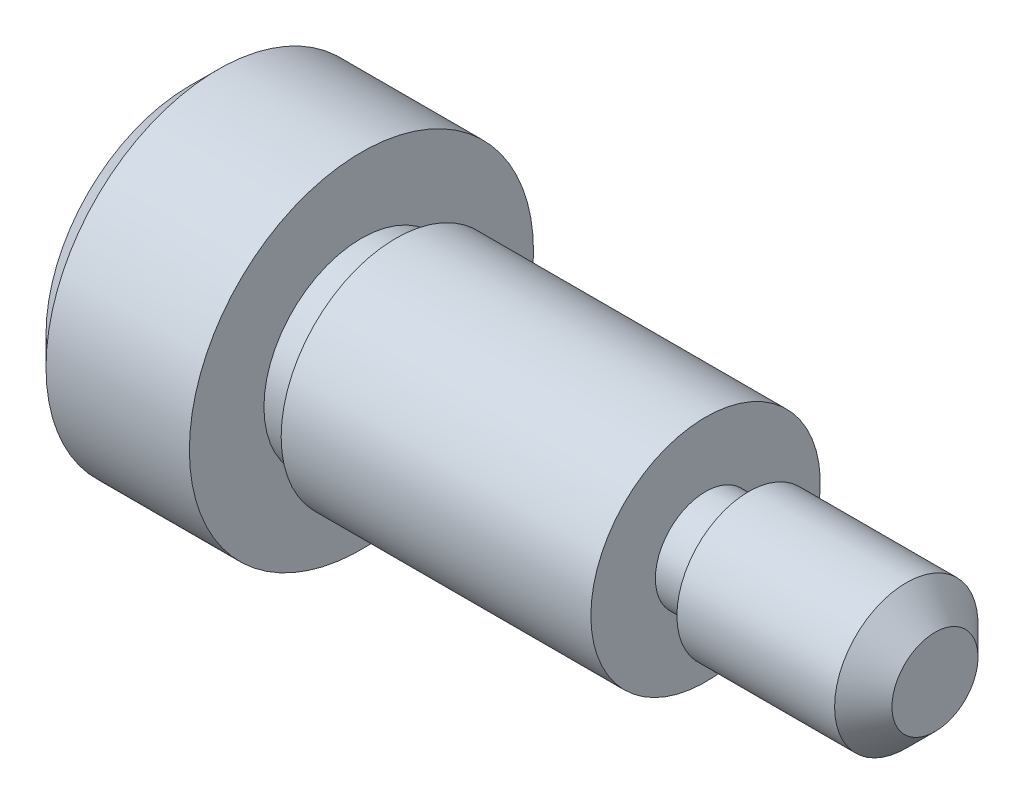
from build123d import *

# Parameters (mm, degrees)
UNDERCUT_SKETCH_W   = 0.6
UNDERCUT_SKETCH_H   = 0.3
UNDERCUT_SKETCH_W_2 = 0.75
UNDERCUT_SKETCH_H_2 = 0.375
HEX_SOCKET_DEPTH    = 1.6
CHAMFER_2_SIZE      = 0.5


with BuildPart() as part:
    # body sketch → body (revolve)
    with BuildSketch(Plane.XY, mode=Mode.PRIVATE) as body_sk:
        Polygon((-3, 0), (10, 0), (10, 1.25), (6, 1.25), (6, 2), (0, 2), (0, 3), (-3, 3), align=None)
    revolve(body_sk.sketch.rotate(Axis((0, 0, 0), (1, 0, 0)), 90), axis=Axis((0, 0, 0), (1, 0, 0)))

    # undercut sketch → undercut (revolve, cut)
    with BuildSketch(Plane.XY, mode=Mode.PRIVATE) as undercut_sk:
        with Locations((0.3, 1.85)):
            Rectangle(UNDERCUT_SKETCH_W, UNDERCUT_SKETCH_H)
        with Locations((6.375, 1.0625)):
            Rectangle(UNDERCUT_SKETCH_W_2, UNDERCUT_SKETCH_H_2)
    revolve(undercut_sk.sketch.rotate(Axis((0, 0, 0), (1, 0, 0)), 90), axis=Axis((0, 0, 0), (1, 0, 0)), mode=Mode.SUBTRACT)

    # hex socket sketch → hex socket (cut)
    with BuildSketch(Plane.ZY.offset(3)):
        Polygon((0.577350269, 1), (-0.577350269, 1), (-1.154700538, 0), (-0.577350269, -1), (0.577350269, -1), (1.154700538, 0), align=None)
    extrude(amount=-HEX_SOCKET_DEPTH, mode=Mode.SUBTRACT)

    # Chamfer 2
    chamfer_2_edges = [part.edges().sort_by_distance(p)[0] for p in [
        (10, 0, -1.25),
        (-3, 0, -3),
    ]]
    chamfer(chamfer_2_edges, length=CHAMFER_2_SIZE)


solid = part.part
